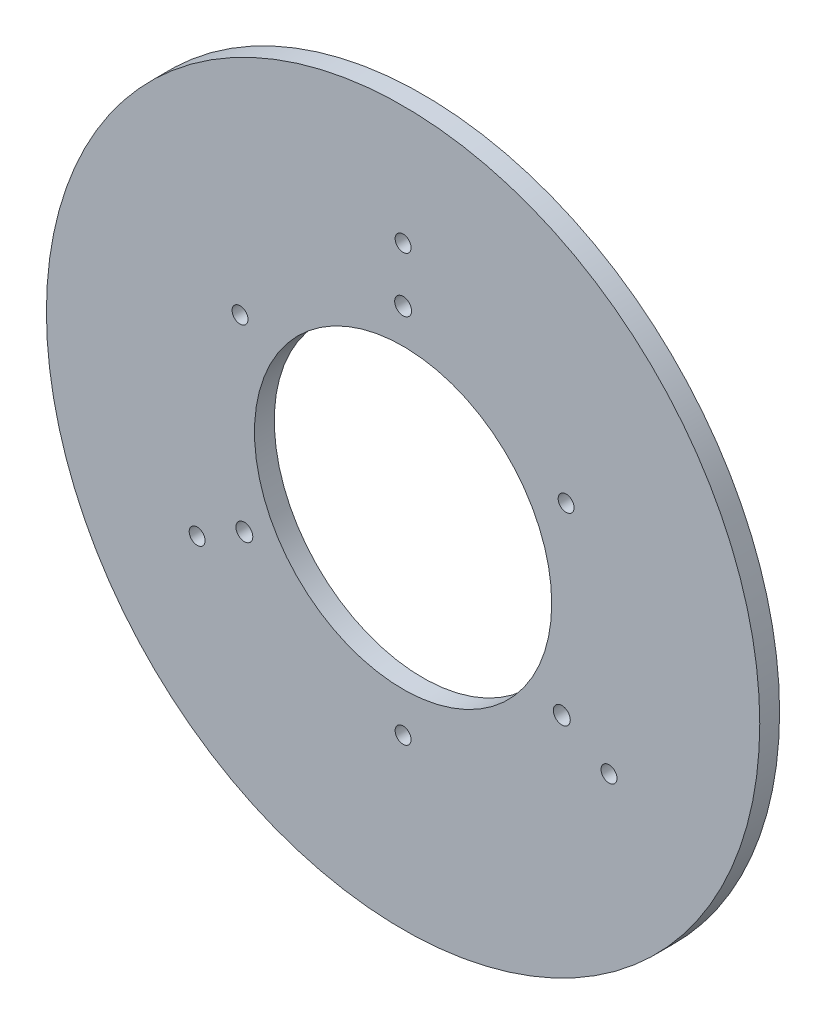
ISO-10303-21;
HEADER;
FILE_DESCRIPTION(('STEP AP214'),'2;1');
FILE_NAME('part.step','',(''),(''),'','','');
FILE_SCHEMA(('AUTOMOTIVE_DESIGN { 1 0 10303 214 1 1 1 1 }'));
ENDSEC;
DATA;
#1=APPLICATION_CONTEXT('core data for automotive mechanical design processes');
#2=APPLICATION_PROTOCOL_DEFINITION('international standard','automotive_design',2000,#1);
#3=PRODUCT_CONTEXT('',#1,'mechanical');
#4=PRODUCT('Part','Part','',(#3));
#5=PRODUCT_RELATED_PRODUCT_CATEGORY('part','',(#4));
#6=PRODUCT_DEFINITION_FORMATION('','',#4);
#7=PRODUCT_DEFINITION_CONTEXT('part definition',#1,'design');
#8=PRODUCT_DEFINITION('design','',#6,#7);
#9=PRODUCT_DEFINITION_SHAPE('','',#8);
#10=(LENGTH_UNIT() NAMED_UNIT(*) SI_UNIT(.MILLI.,.METRE.));
#11=(NAMED_UNIT(*) PLANE_ANGLE_UNIT() SI_UNIT($,.RADIAN.));
#12=(NAMED_UNIT(*) SI_UNIT($,.STERADIAN.) SOLID_ANGLE_UNIT());
#13=UNCERTAINTY_MEASURE_WITH_UNIT(LENGTH_MEASURE(1.E-05),#10,'distance_accuracy_value','');
#14=(GEOMETRIC_REPRESENTATION_CONTEXT(3) GLOBAL_UNCERTAINTY_ASSIGNED_CONTEXT((#13)) GLOBAL_UNIT_ASSIGNED_CONTEXT((#10,
#11,#12)) REPRESENTATION_CONTEXT('',''));
#15=CARTESIAN_POINT('',(0.,0.,0.));
#16=DIRECTION('',(0.,0.,1.));
#17=DIRECTION('',(1.,0.,0.));
#18=AXIS2_PLACEMENT_3D('',#15,#16,#17);
#19=CARTESIAN_POINT('',(0.,0.,6.35));
#20=DIRECTION('',(0.,0.,1.));
#21=DIRECTION('',(1.,0.,0.));
#22=AXIS2_PLACEMENT_3D('',#19,#20,#21);
#23=PLANE('',#22);
#24=CARTESIAN_POINT('',(0.,58.7375,6.35));
#25=DIRECTION('',(0.,0.,1.));
#26=DIRECTION('',(1.,0.,0.));
#27=AXIS2_PLACEMENT_3D('',#24,#25,#26);
#28=CIRCLE('',#27,2.70509999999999);
#29=CARTESIAN_POINT('',(2.70509999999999,58.7375,6.35));
#30=VERTEX_POINT('',#29);
#31=EDGE_CURVE('E101',#30,#30,#28,.T.);
#32=ORIENTED_EDGE('',*,*,#31,.F.);
#33=EDGE_LOOP('',(#32));
#34=FACE_BOUND('',#33,.T.);
#35=CARTESIAN_POINT('',(50.8681671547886,-29.3687499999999,6.35));
#36=DIRECTION('',(0.,0.,1.));
#37=DIRECTION('',(1.,0.,0.));
#38=AXIS2_PLACEMENT_3D('',#35,#36,#37);
#39=CIRCLE('',#38,2.70509999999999);
#40=CARTESIAN_POINT('',(53.5732671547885,-29.3687499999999,6.35));
#41=VERTEX_POINT('',#40);
#42=EDGE_CURVE('E95',#41,#41,#39,.T.);
#43=ORIENTED_EDGE('',*,*,#42,.F.);
#44=EDGE_LOOP('',(#43));
#45=FACE_BOUND('',#44,.T.);
#46=CARTESIAN_POINT('',(-50.8681671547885,-29.3687499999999,6.35));
#47=DIRECTION('',(0.,0.,1.));
#48=DIRECTION('',(1.,0.,0.));
#49=AXIS2_PLACEMENT_3D('',#46,#47,#48);
#50=CIRCLE('',#49,2.70509999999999);
#51=CARTESIAN_POINT('',(-48.1630671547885,-29.3687499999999,6.35));
#52=VERTEX_POINT('',#51);
#53=EDGE_CURVE('E89',#52,#52,#50,.T.);
#54=ORIENTED_EDGE('',*,*,#53,.F.);
#55=EDGE_LOOP('',(#54));
#56=FACE_BOUND('',#55,.T.);
#57=CARTESIAN_POINT('',(-52.2429824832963,30.1624999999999,6.35));
#58=DIRECTION('',(0.,0.,1.));
#59=DIRECTION('',(1.,0.,0.));
#60=AXIS2_PLACEMENT_3D('',#57,#58,#59);
#61=CIRCLE('',#60,2.55269999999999);
#62=CARTESIAN_POINT('',(-49.6902824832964,30.1624999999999,6.35));
#63=VERTEX_POINT('',#62);
#64=EDGE_CURVE('E83',#63,#63,#61,.T.);
#65=ORIENTED_EDGE('',*,*,#64,.F.);
#66=EDGE_LOOP('',(#65));
#67=FACE_BOUND('',#66,.T.);
#68=CARTESIAN_POINT('',(52.2429824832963,30.1624999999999,6.35));
#69=DIRECTION('',(0.,0.,1.));
#70=DIRECTION('',(1.,0.,0.));
#71=AXIS2_PLACEMENT_3D('',#68,#69,#70);
#72=CIRCLE('',#71,2.55269999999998);
#73=CARTESIAN_POINT('',(54.7956824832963,30.1624999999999,6.35));
#74=VERTEX_POINT('',#73);
#75=EDGE_CURVE('E77',#74,#74,#72,.T.);
#76=ORIENTED_EDGE('',*,*,#75,.F.);
#77=EDGE_LOOP('',(#76));
#78=FACE_BOUND('',#77,.T.);
#79=CARTESIAN_POINT('',(0.,-60.325,6.35));
#80=DIRECTION('',(0.,0.,1.));
#81=DIRECTION('',(1.,0.,0.));
#82=AXIS2_PLACEMENT_3D('',#79,#80,#81);
#83=CIRCLE('',#82,2.55269999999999);
#84=CARTESIAN_POINT('',(2.55269999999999,-60.325,6.35));
#85=VERTEX_POINT('',#84);
#86=EDGE_CURVE('E71',#85,#85,#83,.T.);
#87=ORIENTED_EDGE('',*,*,#86,.F.);
#88=EDGE_LOOP('',(#87));
#89=FACE_BOUND('',#88,.T.);
#90=CARTESIAN_POINT('',(0.,76.2,6.35));
#91=DIRECTION('',(0.,0.,1.));
#92=DIRECTION('',(1.,0.,0.));
#93=AXIS2_PLACEMENT_3D('',#90,#91,#92);
#94=CIRCLE('',#93,2.55269999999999);
#95=CARTESIAN_POINT('',(2.55269999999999,76.2,6.35));
#96=VERTEX_POINT('',#95);
#97=EDGE_CURVE('E65',#96,#96,#94,.T.);
#98=ORIENTED_EDGE('',*,*,#97,.F.);
#99=EDGE_LOOP('',(#98));
#100=FACE_BOUND('',#99,.T.);
#101=CARTESIAN_POINT('',(65.9911357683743,-38.0999999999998,6.35));
#102=DIRECTION('',(0.,0.,1.));
#103=DIRECTION('',(1.,0.,0.));
#104=AXIS2_PLACEMENT_3D('',#101,#102,#103);
#105=CIRCLE('',#104,2.55269999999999);
#106=CARTESIAN_POINT('',(68.5438357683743,-38.0999999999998,6.35));
#107=VERTEX_POINT('',#106);
#108=EDGE_CURVE('E59',#107,#107,#105,.T.);
#109=ORIENTED_EDGE('',*,*,#108,.F.);
#110=EDGE_LOOP('',(#109));
#111=FACE_BOUND('',#110,.T.);
#112=CARTESIAN_POINT('',(-65.9911357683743,-38.0999999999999,6.35));
#113=DIRECTION('',(0.,0.,1.));
#114=DIRECTION('',(1.,0.,0.));
#115=AXIS2_PLACEMENT_3D('',#112,#113,#114);
#116=CIRCLE('',#115,2.55269999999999);
#117=CARTESIAN_POINT('',(-63.4384357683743,-38.0999999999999,6.35));
#118=VERTEX_POINT('',#117);
#119=EDGE_CURVE('E53',#118,#118,#116,.T.);
#120=ORIENTED_EDGE('',*,*,#119,.F.);
#121=EDGE_LOOP('',(#120));
#122=FACE_BOUND('',#121,.T.);
#123=CARTESIAN_POINT('',(0.,0.,6.35));
#124=DIRECTION('',(0.,0.,1.));
#125=DIRECTION('',(1.,0.,0.));
#126=AXIS2_PLACEMENT_3D('',#123,#124,#125);
#127=CIRCLE('',#126,114.3);
#128=CARTESIAN_POINT('',(114.3,0.,6.35));
#129=VERTEX_POINT('',#128);
#130=EDGE_CURVE('E10',#129,#129,#127,.T.);
#131=ORIENTED_EDGE('',*,*,#130,.T.);
#132=EDGE_LOOP('',(#131));
#133=FACE_BOUND('',#132,.T.);
#134=CARTESIAN_POINT('',(0.,0.,6.35));
#135=DIRECTION('',(0.,0.,1.));
#136=DIRECTION('',(1.,0.,0.));
#137=AXIS2_PLACEMENT_3D('',#134,#135,#136);
#138=CIRCLE('',#137,47.625);
#139=CARTESIAN_POINT('',(47.625,0.,6.35));
#140=VERTEX_POINT('',#139);
#141=EDGE_CURVE('E43',#140,#140,#138,.T.);
#142=ORIENTED_EDGE('',*,*,#141,.F.);
#143=EDGE_LOOP('',(#142));
#144=FACE_BOUND('',#143,.T.);
#145=ADVANCED_FACE('F32',(#34,#45,#56,#67,#78,#89,#100,#111,#122,#133,#144),#23,.T.);
#146=CARTESIAN_POINT('',(0.,0.,0.));
#147=DIRECTION('',(0.,0.,1.));
#148=DIRECTION('',(1.,0.,0.));
#149=AXIS2_PLACEMENT_3D('',#146,#147,#148);
#150=PLANE('',#149);
#151=CARTESIAN_POINT('',(0.,58.7375,0.));
#152=DIRECTION('',(0.,0.,1.));
#153=DIRECTION('',(1.,0.,0.));
#154=AXIS2_PLACEMENT_3D('',#151,#152,#153);
#155=CIRCLE('',#154,2.7051);
#156=CARTESIAN_POINT('',(2.7051,58.7375,0.));
#157=VERTEX_POINT('',#156);
#158=EDGE_CURVE('E98',#157,#157,#155,.T.);
#159=ORIENTED_EDGE('',*,*,#158,.T.);
#160=EDGE_LOOP('',(#159));
#161=FACE_BOUND('',#160,.T.);
#162=CARTESIAN_POINT('',(50.8681671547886,-29.3687499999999,0.));
#163=DIRECTION('',(0.,0.,1.));
#164=DIRECTION('',(1.,0.,0.));
#165=AXIS2_PLACEMENT_3D('',#162,#163,#164);
#166=CIRCLE('',#165,2.70509999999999);
#167=CARTESIAN_POINT('',(53.5732671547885,-29.3687499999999,0.));
#168=VERTEX_POINT('',#167);
#169=EDGE_CURVE('E92',#168,#168,#166,.T.);
#170=ORIENTED_EDGE('',*,*,#169,.T.);
#171=EDGE_LOOP('',(#170));
#172=FACE_BOUND('',#171,.T.);
#173=CARTESIAN_POINT('',(-50.8681671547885,-29.3687499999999,0.));
#174=DIRECTION('',(0.,0.,1.));
#175=DIRECTION('',(1.,0.,0.));
#176=AXIS2_PLACEMENT_3D('',#173,#174,#175);
#177=CIRCLE('',#176,2.70509999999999);
#178=CARTESIAN_POINT('',(-48.1630671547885,-29.3687499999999,0.));
#179=VERTEX_POINT('',#178);
#180=EDGE_CURVE('E86',#179,#179,#177,.T.);
#181=ORIENTED_EDGE('',*,*,#180,.T.);
#182=EDGE_LOOP('',(#181));
#183=FACE_BOUND('',#182,.T.);
#184=CARTESIAN_POINT('',(-52.2429824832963,30.1624999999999,0.));
#185=DIRECTION('',(0.,0.,1.));
#186=DIRECTION('',(1.,0.,0.));
#187=AXIS2_PLACEMENT_3D('',#184,#185,#186);
#188=CIRCLE('',#187,2.5527);
#189=CARTESIAN_POINT('',(-49.6902824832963,30.1624999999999,0.));
#190=VERTEX_POINT('',#189);
#191=EDGE_CURVE('E80',#190,#190,#188,.T.);
#192=ORIENTED_EDGE('',*,*,#191,.T.);
#193=EDGE_LOOP('',(#192));
#194=FACE_BOUND('',#193,.T.);
#195=CARTESIAN_POINT('',(52.2429824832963,30.1624999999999,0.));
#196=DIRECTION('',(0.,0.,1.));
#197=DIRECTION('',(1.,0.,0.));
#198=AXIS2_PLACEMENT_3D('',#195,#196,#197);
#199=CIRCLE('',#198,2.5527);
#200=CARTESIAN_POINT('',(54.7956824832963,30.1624999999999,0.));
#201=VERTEX_POINT('',#200);
#202=EDGE_CURVE('E74',#201,#201,#199,.T.);
#203=ORIENTED_EDGE('',*,*,#202,.T.);
#204=EDGE_LOOP('',(#203));
#205=FACE_BOUND('',#204,.T.);
#206=CARTESIAN_POINT('',(0.,-60.325,0.));
#207=DIRECTION('',(0.,0.,1.));
#208=DIRECTION('',(1.,0.,0.));
#209=AXIS2_PLACEMENT_3D('',#206,#207,#208);
#210=CIRCLE('',#209,2.5527);
#211=CARTESIAN_POINT('',(2.5527,-60.325,0.));
#212=VERTEX_POINT('',#211);
#213=EDGE_CURVE('E68',#212,#212,#210,.T.);
#214=ORIENTED_EDGE('',*,*,#213,.T.);
#215=EDGE_LOOP('',(#214));
#216=FACE_BOUND('',#215,.T.);
#217=CARTESIAN_POINT('',(0.,76.2,0.));
#218=DIRECTION('',(0.,0.,1.));
#219=DIRECTION('',(1.,0.,0.));
#220=AXIS2_PLACEMENT_3D('',#217,#218,#219);
#221=CIRCLE('',#220,2.5527);
#222=CARTESIAN_POINT('',(2.5527,76.2,0.));
#223=VERTEX_POINT('',#222);
#224=EDGE_CURVE('E62',#223,#223,#221,.T.);
#225=ORIENTED_EDGE('',*,*,#224,.T.);
#226=EDGE_LOOP('',(#225));
#227=FACE_BOUND('',#226,.T.);
#228=CARTESIAN_POINT('',(65.9911357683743,-38.0999999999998,0.));
#229=DIRECTION('',(0.,0.,1.));
#230=DIRECTION('',(1.,0.,0.));
#231=AXIS2_PLACEMENT_3D('',#228,#229,#230);
#232=CIRCLE('',#231,2.55269999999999);
#233=CARTESIAN_POINT('',(68.5438357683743,-38.0999999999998,0.));
#234=VERTEX_POINT('',#233);
#235=EDGE_CURVE('E56',#234,#234,#232,.T.);
#236=ORIENTED_EDGE('',*,*,#235,.T.);
#237=EDGE_LOOP('',(#236));
#238=FACE_BOUND('',#237,.T.);
#239=CARTESIAN_POINT('',(-65.9911357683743,-38.0999999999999,0.));
#240=DIRECTION('',(0.,0.,1.));
#241=DIRECTION('',(1.,0.,0.));
#242=AXIS2_PLACEMENT_3D('',#239,#240,#241);
#243=CIRCLE('',#242,2.55269999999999);
#244=CARTESIAN_POINT('',(-63.4384357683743,-38.0999999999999,0.));
#245=VERTEX_POINT('',#244);
#246=EDGE_CURVE('E48',#245,#245,#243,.T.);
#247=ORIENTED_EDGE('',*,*,#246,.T.);
#248=EDGE_LOOP('',(#247));
#249=FACE_BOUND('',#248,.T.);
#250=CARTESIAN_POINT('',(0.,0.,0.));
#251=DIRECTION('',(0.,0.,1.));
#252=DIRECTION('',(1.,0.,0.));
#253=AXIS2_PLACEMENT_3D('',#250,#251,#252);
#254=CIRCLE('',#253,114.3);
#255=CARTESIAN_POINT('',(114.3,0.,0.));
#256=VERTEX_POINT('',#255);
#257=EDGE_CURVE('E36',#256,#256,#254,.T.);
#258=ORIENTED_EDGE('',*,*,#257,.F.);
#259=EDGE_LOOP('',(#258));
#260=FACE_BOUND('',#259,.T.);
#261=CARTESIAN_POINT('',(0.,0.,0.));
#262=DIRECTION('',(0.,0.,1.));
#263=DIRECTION('',(1.,0.,0.));
#264=AXIS2_PLACEMENT_3D('',#261,#262,#263);
#265=CIRCLE('',#264,47.625);
#266=CARTESIAN_POINT('',(47.625,0.,0.));
#267=VERTEX_POINT('',#266);
#268=EDGE_CURVE('E45',#267,#267,#265,.T.);
#269=ORIENTED_EDGE('',*,*,#268,.T.);
#270=EDGE_LOOP('',(#269));
#271=FACE_BOUND('',#270,.T.);
#272=ADVANCED_FACE('F109',(#161,#172,#183,#194,#205,#216,#227,#238,#249,#260,#271),#150,.F.);
#273=CARTESIAN_POINT('',(0.,0.,6.35));
#274=DIRECTION('',(0.,0.,-1.));
#275=DIRECTION('',(-1.,0.,0.));
#276=AXIS2_PLACEMENT_3D('',#273,#274,#275);
#277=CYLINDRICAL_SURFACE('',#276,114.3);
#278=ORIENTED_EDGE('',*,*,#130,.F.);
#279=EDGE_LOOP('',(#278));
#280=FACE_BOUND('',#279,.T.);
#281=ORIENTED_EDGE('',*,*,#257,.T.);
#282=EDGE_LOOP('',(#281));
#283=FACE_BOUND('',#282,.T.);
#284=ADVANCED_FACE('F34',(#280,#283),#277,.T.);
#285=CARTESIAN_POINT('',(0.,0.,6.35));
#286=DIRECTION('',(0.,0.,-1.));
#287=DIRECTION('',(-1.,0.,0.));
#288=AXIS2_PLACEMENT_3D('',#285,#286,#287);
#289=CYLINDRICAL_SURFACE('',#288,47.625);
#290=ORIENTED_EDGE('',*,*,#141,.T.);
#291=EDGE_LOOP('',(#290));
#292=FACE_BOUND('',#291,.T.);
#293=ORIENTED_EDGE('',*,*,#268,.F.);
#294=EDGE_LOOP('',(#293));
#295=FACE_BOUND('',#294,.T.);
#296=ADVANCED_FACE('F129',(#292,#295),#289,.F.);
#297=CARTESIAN_POINT('',(-65.9911357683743,-38.0999999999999,6.35));
#298=DIRECTION('',(0.,0.,1.));
#299=DIRECTION('',(1.,0.,0.));
#300=AXIS2_PLACEMENT_3D('',#297,#298,#299);
#301=CYLINDRICAL_SURFACE('',#300,2.55269999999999);
#302=ORIENTED_EDGE('',*,*,#246,.F.);
#303=EDGE_LOOP('',(#302));
#304=FACE_BOUND('',#303,.T.);
#305=ORIENTED_EDGE('',*,*,#119,.T.);
#306=EDGE_LOOP('',(#305));
#307=FACE_BOUND('',#306,.T.);
#308=ADVANCED_FACE('F132',(#304,#307),#301,.F.);
#309=CARTESIAN_POINT('',(65.9911357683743,-38.0999999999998,6.35));
#310=DIRECTION('',(0.,0.,1.));
#311=DIRECTION('',(1.,0.,0.));
#312=AXIS2_PLACEMENT_3D('',#309,#310,#311);
#313=CYLINDRICAL_SURFACE('',#312,2.55269999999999);
#314=ORIENTED_EDGE('',*,*,#235,.F.);
#315=EDGE_LOOP('',(#314));
#316=FACE_BOUND('',#315,.T.);
#317=ORIENTED_EDGE('',*,*,#108,.T.);
#318=EDGE_LOOP('',(#317));
#319=FACE_BOUND('',#318,.T.);
#320=ADVANCED_FACE('F146',(#316,#319),#313,.F.);
#321=CARTESIAN_POINT('',(0.,76.2,6.35));
#322=DIRECTION('',(0.,0.,1.));
#323=DIRECTION('',(1.,0.,0.));
#324=AXIS2_PLACEMENT_3D('',#321,#322,#323);
#325=CYLINDRICAL_SURFACE('',#324,2.55269999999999);
#326=ORIENTED_EDGE('',*,*,#224,.F.);
#327=EDGE_LOOP('',(#326));
#328=FACE_BOUND('',#327,.T.);
#329=ORIENTED_EDGE('',*,*,#97,.T.);
#330=EDGE_LOOP('',(#329));
#331=FACE_BOUND('',#330,.T.);
#332=ADVANCED_FACE('F150',(#328,#331),#325,.F.);
#333=CARTESIAN_POINT('',(0.,-60.325,6.35));
#334=DIRECTION('',(0.,0.,1.));
#335=DIRECTION('',(1.,0.,0.));
#336=AXIS2_PLACEMENT_3D('',#333,#334,#335);
#337=CYLINDRICAL_SURFACE('',#336,2.55269999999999);
#338=ORIENTED_EDGE('',*,*,#213,.F.);
#339=EDGE_LOOP('',(#338));
#340=FACE_BOUND('',#339,.T.);
#341=ORIENTED_EDGE('',*,*,#86,.T.);
#342=EDGE_LOOP('',(#341));
#343=FACE_BOUND('',#342,.T.);
#344=ADVANCED_FACE('F154',(#340,#343),#337,.F.);
#345=CARTESIAN_POINT('',(52.2429824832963,30.1624999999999,6.35));
#346=DIRECTION('',(0.,0.,1.));
#347=DIRECTION('',(1.,0.,0.));
#348=AXIS2_PLACEMENT_3D('',#345,#346,#347);
#349=CYLINDRICAL_SURFACE('',#348,2.55269999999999);
#350=ORIENTED_EDGE('',*,*,#202,.F.);
#351=EDGE_LOOP('',(#350));
#352=FACE_BOUND('',#351,.T.);
#353=ORIENTED_EDGE('',*,*,#75,.T.);
#354=EDGE_LOOP('',(#353));
#355=FACE_BOUND('',#354,.T.);
#356=ADVANCED_FACE('F158',(#352,#355),#349,.F.);
#357=CARTESIAN_POINT('',(-52.2429824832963,30.1624999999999,6.35));
#358=DIRECTION('',(0.,0.,1.));
#359=DIRECTION('',(1.,0.,0.));
#360=AXIS2_PLACEMENT_3D('',#357,#358,#359);
#361=CYLINDRICAL_SURFACE('',#360,2.55269999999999);
#362=ORIENTED_EDGE('',*,*,#191,.F.);
#363=EDGE_LOOP('',(#362));
#364=FACE_BOUND('',#363,.T.);
#365=ORIENTED_EDGE('',*,*,#64,.T.);
#366=EDGE_LOOP('',(#365));
#367=FACE_BOUND('',#366,.T.);
#368=ADVANCED_FACE('F162',(#364,#367),#361,.F.);
#369=CARTESIAN_POINT('',(-50.8681671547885,-29.3687499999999,6.35));
#370=DIRECTION('',(0.,0.,1.));
#371=DIRECTION('',(1.,0.,0.));
#372=AXIS2_PLACEMENT_3D('',#369,#370,#371);
#373=CYLINDRICAL_SURFACE('',#372,2.70509999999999);
#374=ORIENTED_EDGE('',*,*,#180,.F.);
#375=EDGE_LOOP('',(#374));
#376=FACE_BOUND('',#375,.T.);
#377=ORIENTED_EDGE('',*,*,#53,.T.);
#378=EDGE_LOOP('',(#377));
#379=FACE_BOUND('',#378,.T.);
#380=ADVANCED_FACE('F166',(#376,#379),#373,.F.);
#381=CARTESIAN_POINT('',(50.8681671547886,-29.3687499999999,6.35));
#382=DIRECTION('',(0.,0.,1.));
#383=DIRECTION('',(1.,0.,0.));
#384=AXIS2_PLACEMENT_3D('',#381,#382,#383);
#385=CYLINDRICAL_SURFACE('',#384,2.70509999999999);
#386=ORIENTED_EDGE('',*,*,#169,.F.);
#387=EDGE_LOOP('',(#386));
#388=FACE_BOUND('',#387,.T.);
#389=ORIENTED_EDGE('',*,*,#42,.T.);
#390=EDGE_LOOP('',(#389));
#391=FACE_BOUND('',#390,.T.);
#392=ADVANCED_FACE('F170',(#388,#391),#385,.F.);
#393=CARTESIAN_POINT('',(0.,58.7375,6.35));
#394=DIRECTION('',(0.,0.,1.));
#395=DIRECTION('',(1.,0.,0.));
#396=AXIS2_PLACEMENT_3D('',#393,#394,#395);
#397=CYLINDRICAL_SURFACE('',#396,2.70509999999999);
#398=ORIENTED_EDGE('',*,*,#158,.F.);
#399=EDGE_LOOP('',(#398));
#400=FACE_BOUND('',#399,.T.);
#401=ORIENTED_EDGE('',*,*,#31,.T.);
#402=EDGE_LOOP('',(#401));
#403=FACE_BOUND('',#402,.T.);
#404=ADVANCED_FACE('F105',(#400,#403),#397,.F.);
#405=CLOSED_SHELL('',(#145,#272,#284,#296,#308,#320,#332,#344,#356,#368,#380,#392,#404));
#406=MANIFOLD_SOLID_BREP('B2',#405);
#407=ADVANCED_BREP_SHAPE_REPRESENTATION('',(#18,#406),#14);
#408=SHAPE_DEFINITION_REPRESENTATION(#9,#407);
ENDSEC;
END-ISO-10303-21;
